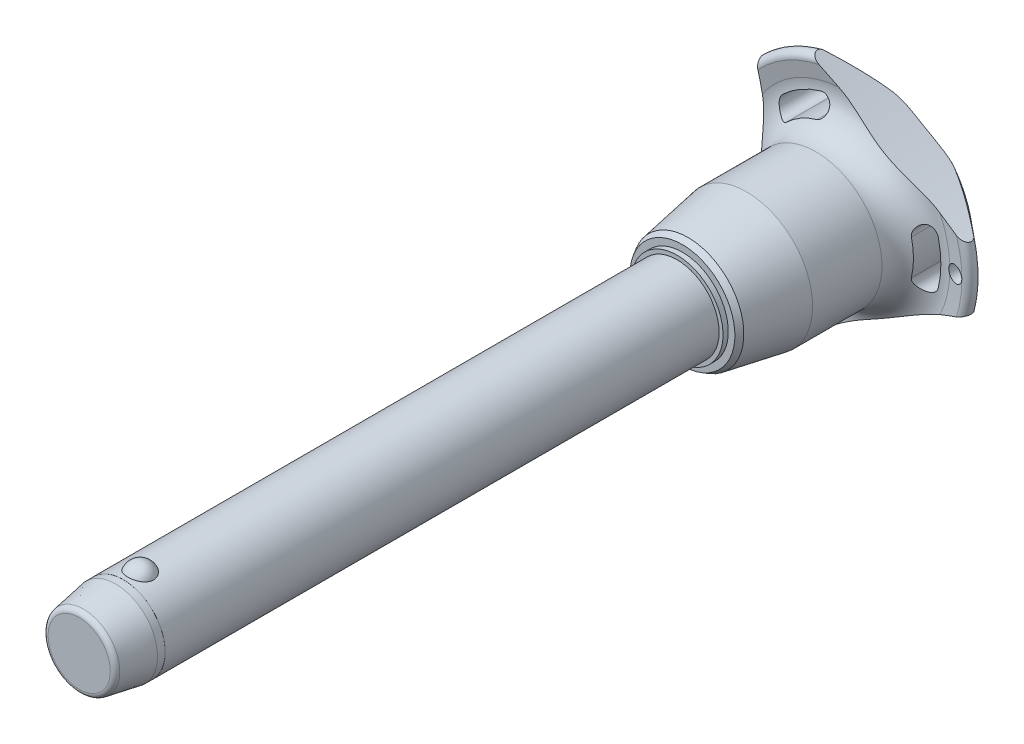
from build123d import *

# Parameters (mm, degrees)
SKETCH1_R           = 8
BOSS_EXTRUDE1_DEPTH = 100
SKETCH2_R           = 7
BOSS_EXTRUDE2_DEPTH = 39.7
BOSS_EXTRUDE3_START = 14
SKETCH1_2_R         = 8
BOSS_EXTRUDE3_DEPTH = 14
CHAMFER1_SIZE       = 7
CHAMFER1_SIZE2      = 1.234288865
FILLET1_R           = 1
SKETCH6_R           = 144.275
CUT_EXTRUDE1_DEPTH  = 144.700393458
CIRPATTERN1_COUNT   = 3
SKETCH7_R           = 1.5
CUT_EXTRUDE2_DEPTH  = 144.560667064
SKETCH8_R           = 8
SKETCH8_R_2         = 7.99
CUT_EXTRUDE3_DEPTH  = 8.4


with BuildPart() as part:
    # Sketch1 → Boss-Extrude1 (new body)
    with BuildSketch(Plane.XY):
        Circle(SKETCH1_R)
    extrude(amount=-BOSS_EXTRUDE1_DEPTH)

    # Sketch2 → Boss-Extrude2 (add)
    with BuildSketch(Plane(origin=(0, 0, -100), x_dir=(-1, 0, 0), z_dir=(0, 0, -1))):
        Circle(SKETCH2_R)
    extrude(amount=BOSS_EXTRUDE2_DEPTH)

    # Sketch3 → Revolve1 (revolve)
    with BuildSketch(Plane(origin=(0, 0, 0), x_dir=(0, 0, -1), z_dir=(1, 0, 0))):
        with BuildLine():
            Line((-2.387467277, 9.5), (-2.387467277, 4.2))
            ThreePointArc((-2.387467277, 4.2), (0.262532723, 6.85), (-2.387467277, 9.5))
        make_face()
        with BuildLine():
            Line((-2.387467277, -4.2), (-2.387467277, -9.5))
            ThreePointArc((-2.387467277, -9.5), (0.262532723, -6.85), (-2.387467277, -4.2))
        make_face()
    revolve(axis=Axis((0, -4.2, 2.387467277), (0, 1, 0)))

    # Sketch1_2 → Boss-Extrude3 (add)
    with BuildSketch(Plane.XY.offset(BOSS_EXTRUDE3_START)):
        Circle(SKETCH1_2_R)
    extrude(amount=-BOSS_EXTRUDE3_DEPTH)

    # Chamfer1
    chamfer1_edges = [part.edges().sort_by_distance(p)[0] for p in [
        (-8, 0, 14),
    ]]
    chamfer1_side = [part.faces().sort_by_distance(p)[0] for p in [
        (-8, 0, -43),
    ]]
    chamfer(chamfer1_edges, length=CHAMFER1_SIZE, length2=CHAMFER1_SIZE2, reference=chamfer1_side[0])

    # Fillet1
    fillet1_edges = [part.edges().sort_by_distance(p)[0] for p in [
        (-6.765711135, 0, 14),
        (7, 0, -139.7),
    ]]
    fillet(fillet1_edges, radius=FILLET1_R)

    # Sketch4 → Revolve2 (revolve)
    with BuildSketch(Plane(origin=(0, 0, 0), x_dir=(0, 0, -1), z_dir=(1, 0, 0)), mode=Mode.PRIVATE) as revolve2_sk:
        Polygon((100, 0), (100, 8.754868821), (101, 8.754868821), (101, 10.007796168), (102.085066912, 10.634259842), (113.233333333, 12.6), (126.466666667, 12.6), (126.466666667, 0), align=None)
    revolve(revolve2_sk.sketch.rotate(Axis((0, 0, -126.466666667), (0, 0, 1)), 90), axis=Axis((0, 0, -126.466666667), (0, 0, 1)))

    # Sketch5 → Revolve3 (revolve)
    with BuildSketch(Plane(origin=(0, 0, 0), x_dir=(0, 0, -1), z_dir=(1, 0, 0)), mode=Mode.PRIVATE) as revolve3_sk:
        with BuildLine():
            Line((132.379459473, 19.619255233), (131.900774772, 22.396148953))
            ThreePointArc((131.900774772, 22.396148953), (132.578274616, 23.688538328), (134.002586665, 23.371345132))
            Line((134.002586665, 23.371345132), (139.141488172, 17.247040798))
            ThreePointArc((139.141488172, 17.247040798), (139.7, 15.584758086), (138.978803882, 13.986322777))
            ThreePointArc((138.978803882, 13.986322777), (134.617427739, 7.589034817), (133.083333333, 0))
            Line((133.083333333, 0), (126.466666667, 0))
            Line((126.466666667, 0), (126.466666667, 12.6))
            ThreePointArc((126.466666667, 12.6), (131.055540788, 14.734481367), (132.379459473, 19.619255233))
        make_face()
    revolve(revolve3_sk.sketch.rotate(Axis((0, 0, -133.083333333), (0, 0, 1)), 90), axis=Axis((0, 0, -133.083333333), (0, 0, 1)))

    # Sketch6 → Cut-Extrude1 (cut, through all)
    with BuildSketch(Plane.XY):
        with Locations((-159.975, 0)):
            Circle(SKETCH6_R)
        with BuildLine():
            ThreePointArc((17.365443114, -4.192809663), (17.864441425, 0), (17.365443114, 4.192809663))
            ThreePointArc((17.365443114, 4.192809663), (15.247788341, 5.486749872), (13.953848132, 3.369095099))
            ThreePointArc((13.953848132, 3.369095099), (14.354813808, 0), (13.953848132, -3.369095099))
            ThreePointArc((13.953848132, -3.369095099), (15.247788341, -5.486749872), (17.365443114, -4.192809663))
        make_face()
    cut_extrude1 = extrude(amount=-CUT_EXTRUDE1_DEPTH, mode=Mode.SUBTRACT)

    # CirPattern1: Cut-Extrude1 ×3 about axis
    cirpattern1_axis = Axis((0, 0, 0), (0, 0, 1))
    for i in range(1, CIRPATTERN1_COUNT):
        add(cut_extrude1.rotate(cirpattern1_axis, i * 360 / CIRPATTERN1_COUNT), mode=Mode.SUBTRACT)

    # Sketch7 → Cut-Extrude2 (cut, through all)
    with BuildSketch(Plane.XY):
        with Locations(Location((20.864441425, 0, 0), (0, 0, 221.008319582))):
            Circle(SKETCH7_R)
    extrude(amount=-CUT_EXTRUDE2_DEPTH, mode=Mode.SUBTRACT)

    # Sketch8 → Cut-Extrude3 (cut)
    with BuildSketch(Plane.XY.offset(14)):
        Circle(SKETCH8_R)
        Circle(SKETCH8_R_2, mode=Mode.SUBTRACT)
    extrude(amount=-CUT_EXTRUDE3_DEPTH, mode=Mode.SUBTRACT)


solid = part.part
